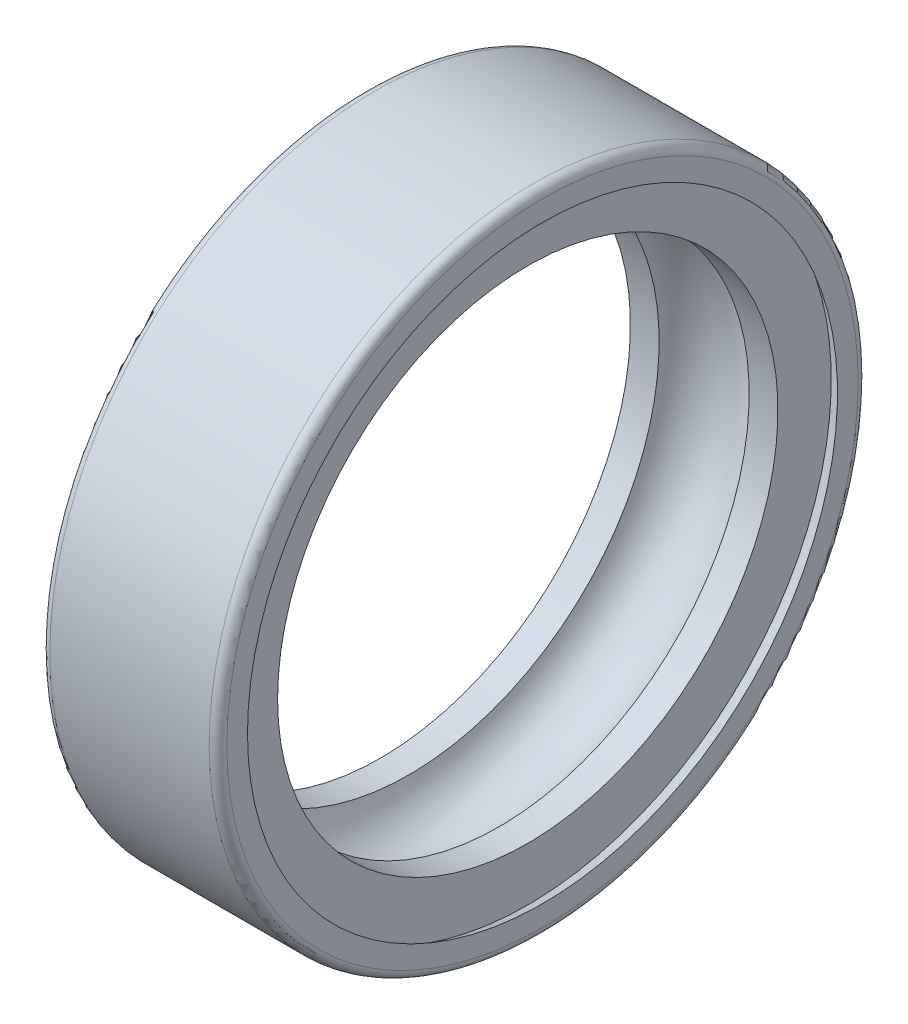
ISO-10303-21;
HEADER;
FILE_DESCRIPTION(('STEP AP214'),'2;1');
FILE_NAME('part.step','',(''),(''),'','','');
FILE_SCHEMA(('AUTOMOTIVE_DESIGN { 1 0 10303 214 1 1 1 1 }'));
ENDSEC;
DATA;
#1=APPLICATION_CONTEXT('core data for automotive mechanical design processes');
#2=APPLICATION_PROTOCOL_DEFINITION('international standard','automotive_design',2000,#1);
#3=PRODUCT_CONTEXT('',#1,'mechanical');
#4=PRODUCT('Part','Part','',(#3));
#5=PRODUCT_RELATED_PRODUCT_CATEGORY('part','',(#4));
#6=PRODUCT_DEFINITION_FORMATION('','',#4);
#7=PRODUCT_DEFINITION_CONTEXT('part definition',#1,'design');
#8=PRODUCT_DEFINITION('design','',#6,#7);
#9=PRODUCT_DEFINITION_SHAPE('','',#8);
#10=(LENGTH_UNIT() NAMED_UNIT(*) SI_UNIT(.MILLI.,.METRE.));
#11=(NAMED_UNIT(*) PLANE_ANGLE_UNIT() SI_UNIT($,.RADIAN.));
#12=(NAMED_UNIT(*) SI_UNIT($,.STERADIAN.) SOLID_ANGLE_UNIT());
#13=UNCERTAINTY_MEASURE_WITH_UNIT(LENGTH_MEASURE(1.E-05),#10,'distance_accuracy_value','');
#14=(GEOMETRIC_REPRESENTATION_CONTEXT(3) GLOBAL_UNCERTAINTY_ASSIGNED_CONTEXT((#13)) GLOBAL_UNIT_ASSIGNED_CONTEXT((#10,
#11,#12)) REPRESENTATION_CONTEXT('',''));
#15=CARTESIAN_POINT('',(0.,0.,0.));
#16=DIRECTION('',(0.,0.,1.));
#17=DIRECTION('',(1.,0.,0.));
#18=AXIS2_PLACEMENT_3D('',#15,#16,#17);
#19=CARTESIAN_POINT('',(0.,0.,0.));
#20=DIRECTION('',(-1.,0.,0.));
#21=DIRECTION('',(0.,0.,1.));
#22=AXIS2_PLACEMENT_3D('',#19,#20,#21);
#23=CYLINDRICAL_SURFACE('',#22,8.48);
#24=CARTESIAN_POINT('',(5.5,0.,0.));
#25=DIRECTION('',(-1.,0.,0.));
#26=DIRECTION('',(0.,0.,1.));
#27=AXIS2_PLACEMENT_3D('',#24,#25,#26);
#28=CIRCLE('',#27,8.48);
#29=CARTESIAN_POINT('',(5.5,0.,8.48));
#30=VERTEX_POINT('',#29);
#31=EDGE_CURVE('E10',#30,#30,#28,.T.);
#32=ORIENTED_EDGE('',*,*,#31,.F.);
#33=EDGE_LOOP('',(#32));
#34=FACE_BOUND('',#33,.T.);
#35=CARTESIAN_POINT('',(4.52630272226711,0.,0.));
#36=DIRECTION('',(-1.,0.,0.));
#37=DIRECTION('',(0.,0.,1.));
#38=AXIS2_PLACEMENT_3D('',#35,#36,#37);
#39=CIRCLE('',#38,8.48);
#40=CARTESIAN_POINT('',(4.52630272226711,0.,8.48));
#41=VERTEX_POINT('',#40);
#42=EDGE_CURVE('E73',#41,#41,#39,.T.);
#43=ORIENTED_EDGE('',*,*,#42,.T.);
#44=EDGE_LOOP('',(#43));
#45=FACE_BOUND('',#44,.T.);
#46=ADVANCED_FACE('F15',(#34,#45),#23,.F.);
#47=CARTESIAN_POINT('',(5.5,8.48,0.));
#48=DIRECTION('',(-1.,0.,0.));
#49=DIRECTION('',(0.,0.,1.));
#50=AXIS2_PLACEMENT_3D('',#47,#48,#49);
#51=PLANE('',#50);
#52=CARTESIAN_POINT('',(5.5,0.,0.));
#53=DIRECTION('',(-1.,0.,0.));
#54=DIRECTION('',(0.,0.,1.));
#55=AXIS2_PLACEMENT_3D('',#52,#53,#54);
#56=CIRCLE('',#55,10.2886751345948);
#57=CARTESIAN_POINT('',(5.5,0.,10.2886751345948));
#58=VERTEX_POINT('',#57);
#59=EDGE_CURVE('E22',#58,#58,#56,.T.);
#60=ORIENTED_EDGE('',*,*,#59,.F.);
#61=EDGE_LOOP('',(#60));
#62=FACE_BOUND('',#61,.T.);
#63=ORIENTED_EDGE('',*,*,#31,.T.);
#64=EDGE_LOOP('',(#63));
#65=FACE_BOUND('',#64,.T.);
#66=ADVANCED_FACE('F92',(#62,#65),#51,.F.);
#67=CARTESIAN_POINT('',(5.5,0.,0.));
#68=DIRECTION('',(-1.,0.,0.));
#69=DIRECTION('',(0.,0.,1.));
#70=AXIS2_PLACEMENT_3D('',#67,#68,#69);
#71=CONICAL_SURFACE('',#70,10.2886751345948,0.523598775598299);
#72=CARTESIAN_POINT('',(6.,0.,0.));
#73=DIRECTION('',(-1.,0.,0.));
#74=DIRECTION('',(0.,0.,1.));
#75=AXIS2_PLACEMENT_3D('',#72,#73,#74);
#76=CIRCLE('',#75,10.);
#77=CARTESIAN_POINT('',(6.,0.,10.));
#78=VERTEX_POINT('',#77);
#79=EDGE_CURVE('E31',#78,#78,#76,.T.);
#80=ORIENTED_EDGE('',*,*,#79,.F.);
#81=EDGE_LOOP('',(#80));
#82=FACE_BOUND('',#81,.T.);
#83=ORIENTED_EDGE('',*,*,#59,.T.);
#84=EDGE_LOOP('',(#83));
#85=FACE_BOUND('',#84,.T.);
#86=ADVANCED_FACE('F97',(#82,#85),#71,.F.);
#87=CARTESIAN_POINT('',(6.,10.,0.));
#88=DIRECTION('',(-1.,0.,0.));
#89=DIRECTION('',(0.,0.,1.));
#90=AXIS2_PLACEMENT_3D('',#87,#88,#89);
#91=PLANE('',#90);
#92=CARTESIAN_POINT('',(6.,0.,0.));
#93=DIRECTION('',(-1.,0.,0.));
#94=DIRECTION('',(0.,0.,1.));
#95=AXIS2_PLACEMENT_3D('',#92,#93,#94);
#96=CIRCLE('',#95,10.7);
#97=CARTESIAN_POINT('',(6.,0.,10.7));
#98=VERTEX_POINT('',#97);
#99=EDGE_CURVE('E39',#98,#98,#96,.T.);
#100=ORIENTED_EDGE('',*,*,#99,.F.);
#101=EDGE_LOOP('',(#100));
#102=FACE_BOUND('',#101,.T.);
#103=ORIENTED_EDGE('',*,*,#79,.T.);
#104=EDGE_LOOP('',(#103));
#105=FACE_BOUND('',#104,.T.);
#106=ADVANCED_FACE('F102',(#102,#105),#91,.F.);
#107=CARTESIAN_POINT('',(5.7,0.,0.));
#108=DIRECTION('',(-1.,0.,0.));
#109=DIRECTION('',(0.,0.,1.));
#110=AXIS2_PLACEMENT_3D('',#107,#108,#109);
#111=TOROIDAL_SURFACE('',#110,10.7,0.3);
#112=CARTESIAN_POINT('',(5.7,0.,0.));
#113=DIRECTION('',(-1.,0.,0.));
#114=DIRECTION('',(0.,0.,1.));
#115=AXIS2_PLACEMENT_3D('',#112,#113,#114);
#116=CIRCLE('',#115,11.);
#117=CARTESIAN_POINT('',(5.7,0.,11.));
#118=VERTEX_POINT('',#117);
#119=EDGE_CURVE('E45',#118,#118,#116,.T.);
#120=ORIENTED_EDGE('',*,*,#119,.F.);
#121=EDGE_LOOP('',(#120));
#122=FACE_BOUND('',#121,.T.);
#123=ORIENTED_EDGE('',*,*,#99,.T.);
#124=EDGE_LOOP('',(#123));
#125=FACE_BOUND('',#124,.T.);
#126=ADVANCED_FACE('F108',(#122,#125),#111,.T.);
#127=CARTESIAN_POINT('',(0.,0.,0.));
#128=DIRECTION('',(-1.,0.,0.));
#129=DIRECTION('',(0.,0.,1.));
#130=AXIS2_PLACEMENT_3D('',#127,#128,#129);
#131=CYLINDRICAL_SURFACE('',#130,11.);
#132=CARTESIAN_POINT('',(0.3,0.,0.));
#133=DIRECTION('',(-1.,0.,0.));
#134=DIRECTION('',(0.,0.,1.));
#135=AXIS2_PLACEMENT_3D('',#132,#133,#134);
#136=CIRCLE('',#135,11.);
#137=CARTESIAN_POINT('',(0.3,0.,11.));
#138=VERTEX_POINT('',#137);
#139=EDGE_CURVE('E49',#138,#138,#136,.T.);
#140=ORIENTED_EDGE('',*,*,#139,.F.);
#141=EDGE_LOOP('',(#140));
#142=FACE_BOUND('',#141,.T.);
#143=ORIENTED_EDGE('',*,*,#119,.T.);
#144=EDGE_LOOP('',(#143));
#145=FACE_BOUND('',#144,.T.);
#146=ADVANCED_FACE('F112',(#142,#145),#131,.T.);
#147=CARTESIAN_POINT('',(0.3,0.,0.));
#148=DIRECTION('',(-1.,0.,0.));
#149=DIRECTION('',(0.,0.,1.));
#150=AXIS2_PLACEMENT_3D('',#147,#148,#149);
#151=TOROIDAL_SURFACE('',#150,10.7,0.3);
#152=CARTESIAN_POINT('',(0.,0.,0.));
#153=DIRECTION('',(-1.,0.,0.));
#154=DIRECTION('',(0.,0.,1.));
#155=AXIS2_PLACEMENT_3D('',#152,#153,#154);
#156=CIRCLE('',#155,10.7);
#157=CARTESIAN_POINT('',(0.,0.,10.7));
#158=VERTEX_POINT('',#157);
#159=EDGE_CURVE('E53',#158,#158,#156,.T.);
#160=ORIENTED_EDGE('',*,*,#159,.F.);
#161=EDGE_LOOP('',(#160));
#162=FACE_BOUND('',#161,.T.);
#163=ORIENTED_EDGE('',*,*,#139,.T.);
#164=EDGE_LOOP('',(#163));
#165=FACE_BOUND('',#164,.T.);
#166=ADVANCED_FACE('F116',(#162,#165),#151,.T.);
#167=CARTESIAN_POINT('',(0.,10.7,0.));
#168=DIRECTION('',(1.,0.,0.));
#169=DIRECTION('',(0.,0.,-1.));
#170=AXIS2_PLACEMENT_3D('',#167,#168,#169);
#171=PLANE('',#170);
#172=CARTESIAN_POINT('',(0.,0.,0.));
#173=DIRECTION('',(-1.,0.,0.));
#174=DIRECTION('',(0.,0.,1.));
#175=AXIS2_PLACEMENT_3D('',#172,#173,#174);
#176=CIRCLE('',#175,10.);
#177=CARTESIAN_POINT('',(0.,0.,10.));
#178=VERTEX_POINT('',#177);
#179=EDGE_CURVE('E57',#178,#178,#176,.T.);
#180=ORIENTED_EDGE('',*,*,#179,.F.);
#181=EDGE_LOOP('',(#180));
#182=FACE_BOUND('',#181,.T.);
#183=ORIENTED_EDGE('',*,*,#159,.T.);
#184=EDGE_LOOP('',(#183));
#185=FACE_BOUND('',#184,.T.);
#186=ADVANCED_FACE('F120',(#182,#185),#171,.F.);
#187=CARTESIAN_POINT('',(0.,0.,0.));
#188=DIRECTION('',(1.,0.,0.));
#189=DIRECTION('',(0.,0.,-1.));
#190=AXIS2_PLACEMENT_3D('',#187,#188,#189);
#191=CONICAL_SURFACE('',#190,10.,0.523598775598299);
#192=CARTESIAN_POINT('',(0.5,0.,0.));
#193=DIRECTION('',(-1.,0.,0.));
#194=DIRECTION('',(0.,0.,1.));
#195=AXIS2_PLACEMENT_3D('',#192,#193,#194);
#196=CIRCLE('',#195,10.2886751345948);
#197=CARTESIAN_POINT('',(0.5,0.,10.2886751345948));
#198=VERTEX_POINT('',#197);
#199=EDGE_CURVE('E61',#198,#198,#196,.T.);
#200=ORIENTED_EDGE('',*,*,#199,.F.);
#201=EDGE_LOOP('',(#200));
#202=FACE_BOUND('',#201,.T.);
#203=ORIENTED_EDGE('',*,*,#179,.T.);
#204=EDGE_LOOP('',(#203));
#205=FACE_BOUND('',#204,.T.);
#206=ADVANCED_FACE('F124',(#202,#205),#191,.F.);
#207=CARTESIAN_POINT('',(0.5,10.2886751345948,0.));
#208=DIRECTION('',(1.,0.,0.));
#209=DIRECTION('',(0.,0.,-1.));
#210=AXIS2_PLACEMENT_3D('',#207,#208,#209);
#211=PLANE('',#210);
#212=CARTESIAN_POINT('',(0.5,0.,0.));
#213=DIRECTION('',(-1.,0.,0.));
#214=DIRECTION('',(0.,0.,1.));
#215=AXIS2_PLACEMENT_3D('',#212,#213,#214);
#216=CIRCLE('',#215,8.48);
#217=CARTESIAN_POINT('',(0.5,0.,8.48));
#218=VERTEX_POINT('',#217);
#219=EDGE_CURVE('E65',#218,#218,#216,.T.);
#220=ORIENTED_EDGE('',*,*,#219,.F.);
#221=EDGE_LOOP('',(#220));
#222=FACE_BOUND('',#221,.T.);
#223=ORIENTED_EDGE('',*,*,#199,.T.);
#224=EDGE_LOOP('',(#223));
#225=FACE_BOUND('',#224,.T.);
#226=ADVANCED_FACE('F88',(#222,#225),#211,.F.);
#227=CARTESIAN_POINT('',(0.,0.,0.));
#228=DIRECTION('',(-1.,0.,0.));
#229=DIRECTION('',(0.,0.,1.));
#230=AXIS2_PLACEMENT_3D('',#227,#228,#229);
#231=CYLINDRICAL_SURFACE('',#230,8.48);
#232=CARTESIAN_POINT('',(1.47369727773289,0.,0.));
#233=DIRECTION('',(-1.,0.,0.));
#234=DIRECTION('',(0.,0.,1.));
#235=AXIS2_PLACEMENT_3D('',#232,#233,#234);
#236=CIRCLE('',#235,8.48);
#237=CARTESIAN_POINT('',(1.47369727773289,0.,8.48));
#238=VERTEX_POINT('',#237);
#239=EDGE_CURVE('E69',#238,#238,#236,.T.);
#240=ORIENTED_EDGE('',*,*,#239,.F.);
#241=EDGE_LOOP('',(#240));
#242=FACE_BOUND('',#241,.T.);
#243=ORIENTED_EDGE('',*,*,#219,.T.);
#244=EDGE_LOOP('',(#243));
#245=FACE_BOUND('',#244,.T.);
#246=ADVANCED_FACE('F81',(#242,#245),#231,.F.);
#247=CARTESIAN_POINT('',(3.,0.,0.));
#248=DIRECTION('',(-1.,0.,0.));
#249=DIRECTION('',(0.,0.,1.));
#250=AXIS2_PLACEMENT_3D('',#247,#248,#249);
#251=TOROIDAL_SURFACE('',#250,8.,1.6);
#252=ORIENTED_EDGE('',*,*,#239,.T.);
#253=EDGE_LOOP('',(#252));
#254=FACE_BOUND('',#253,.T.);
#255=ORIENTED_EDGE('',*,*,#42,.F.);
#256=EDGE_LOOP('',(#255));
#257=FACE_BOUND('',#256,.T.);
#258=ADVANCED_FACE('F79',(#254,#257),#251,.F.);
#259=CLOSED_SHELL('',(#46,#66,#86,#106,#126,#146,#166,#186,#206,#226,#246,#258));
#260=MANIFOLD_SOLID_BREP('B1',#259);
#261=ADVANCED_BREP_SHAPE_REPRESENTATION('',(#18,#260),#14);
#262=SHAPE_DEFINITION_REPRESENTATION(#9,#261);
ENDSEC;
END-ISO-10303-21;
